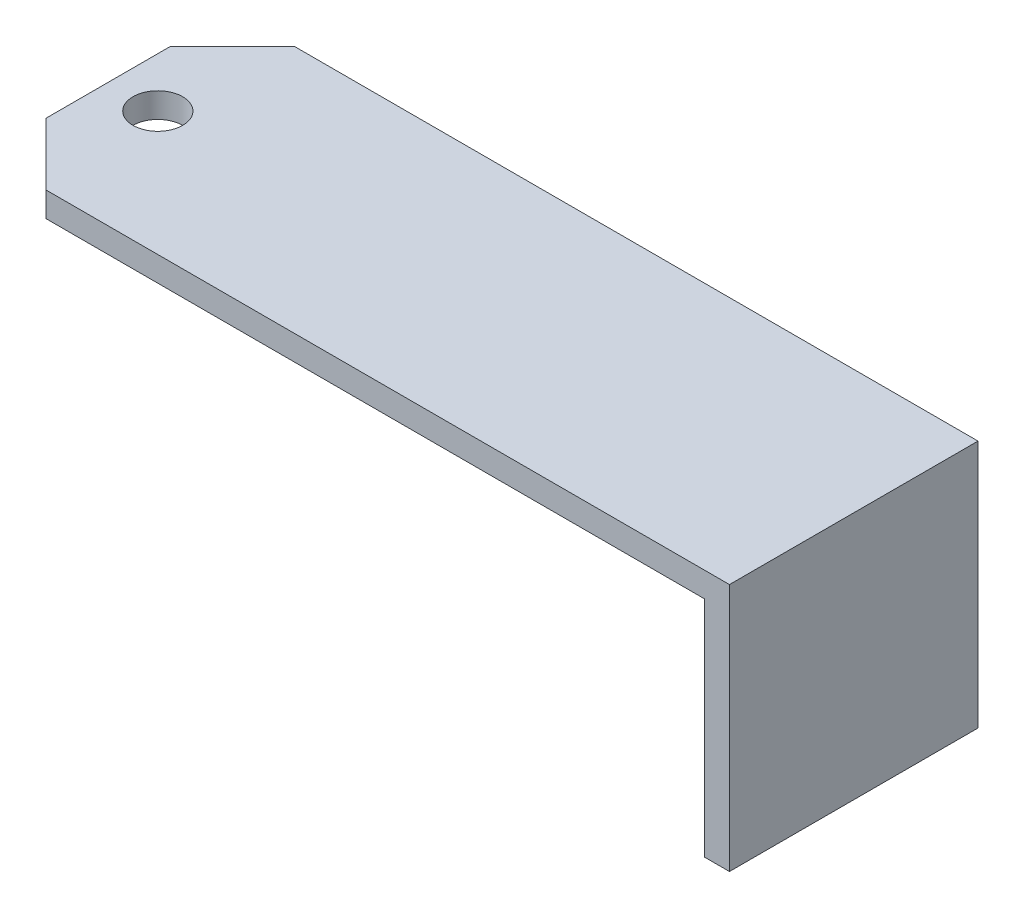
ISO-10303-21;
HEADER;
FILE_DESCRIPTION(('STEP AP214'),'2;1');
FILE_NAME('part.step','',(''),(''),'','','');
FILE_SCHEMA(('AUTOMOTIVE_DESIGN { 1 0 10303 214 1 1 1 1 }'));
ENDSEC;
DATA;
#1=APPLICATION_CONTEXT('core data for automotive mechanical design processes');
#2=APPLICATION_PROTOCOL_DEFINITION('international standard','automotive_design',2000,#1);
#3=PRODUCT_CONTEXT('',#1,'mechanical');
#4=PRODUCT('Part','Part','',(#3));
#5=PRODUCT_RELATED_PRODUCT_CATEGORY('part','',(#4));
#6=PRODUCT_DEFINITION_FORMATION('','',#4);
#7=PRODUCT_DEFINITION_CONTEXT('part definition',#1,'design');
#8=PRODUCT_DEFINITION('design','',#6,#7);
#9=PRODUCT_DEFINITION_SHAPE('','',#8);
#10=(LENGTH_UNIT() NAMED_UNIT(*) SI_UNIT(.MILLI.,.METRE.));
#11=(NAMED_UNIT(*) PLANE_ANGLE_UNIT() SI_UNIT($,.RADIAN.));
#12=(NAMED_UNIT(*) SI_UNIT($,.STERADIAN.) SOLID_ANGLE_UNIT());
#13=UNCERTAINTY_MEASURE_WITH_UNIT(LENGTH_MEASURE(1.E-05),#10,'distance_accuracy_value','');
#14=(GEOMETRIC_REPRESENTATION_CONTEXT(3) GLOBAL_UNCERTAINTY_ASSIGNED_CONTEXT((#13)) GLOBAL_UNIT_ASSIGNED_CONTEXT((#10,
#11,#12)) REPRESENTATION_CONTEXT('',''));
#15=CARTESIAN_POINT('',(0.,0.,0.));
#16=DIRECTION('',(0.,0.,1.));
#17=DIRECTION('',(1.,0.,0.));
#18=AXIS2_PLACEMENT_3D('',#15,#16,#17);
#19=CARTESIAN_POINT('',(0.,0.,0.));
#20=DIRECTION('',(1.,0.,0.));
#21=DIRECTION('',(0.,1.,0.));
#22=AXIS2_PLACEMENT_3D('',#19,#20,#21);
#23=PLANE('',#22);
#24=DIRECTION('',(0.,-1.,0.));
#25=VECTOR('',#24,1.);
#26=CARTESIAN_POINT('',(0.,0.,10.));
#27=LINE('',#26,#25);
#28=CARTESIAN_POINT('',(0.,0.,10.));
#29=VERTEX_POINT('',#28);
#30=CARTESIAN_POINT('',(0.,-20.,10.));
#31=VERTEX_POINT('',#30);
#32=EDGE_CURVE('E179',#29,#31,#27,.T.);
#33=ORIENTED_EDGE('',*,*,#32,.T.);
#34=DIRECTION('',(0.,0.,-1.));
#35=VECTOR('',#34,1.);
#36=CARTESIAN_POINT('',(0.,-20.,10.));
#37=LINE('',#36,#35);
#38=CARTESIAN_POINT('',(0.,-20.,-10.));
#39=VERTEX_POINT('',#38);
#40=EDGE_CURVE('E18',#31,#39,#37,.T.);
#41=ORIENTED_EDGE('',*,*,#40,.T.);
#42=DIRECTION('',(0.,1.,0.));
#43=VECTOR('',#42,1.);
#44=CARTESIAN_POINT('',(0.,-20.,-10.));
#45=LINE('',#44,#43);
#46=CARTESIAN_POINT('',(0.,0.,-10.));
#47=VERTEX_POINT('',#46);
#48=EDGE_CURVE('E194',#39,#47,#45,.T.);
#49=ORIENTED_EDGE('',*,*,#48,.T.);
#50=DIRECTION('',(0.,0.,1.));
#51=VECTOR('',#50,1.);
#52=CARTESIAN_POINT('',(0.,0.,-10.));
#53=LINE('',#52,#51);
#54=EDGE_CURVE('E9',#47,#29,#53,.T.);
#55=ORIENTED_EDGE('',*,*,#54,.T.);
#56=EDGE_LOOP('',(#33,#41,#49,#55));
#57=FACE_BOUND('',#56,.T.);
#58=ADVANCED_FACE('F15',(#57),#23,.T.);
#59=CARTESIAN_POINT('',(-60.,0.,0.));
#60=DIRECTION('',(0.,1.,0.));
#61=DIRECTION('',(1.,0.,0.));
#62=AXIS2_PLACEMENT_3D('',#59,#60,#61);
#63=PLANE('',#62);
#64=CARTESIAN_POINT('',(-56.,0.,0.));
#65=DIRECTION('',(0.,-1.,0.));
#66=DIRECTION('',(-1.,0.,0.));
#67=AXIS2_PLACEMENT_3D('',#64,#65,#66);
#68=CIRCLE('',#67,2.);
#69=CARTESIAN_POINT('',(-54.,0.,0.));
#70=VERTEX_POINT('',#69);
#71=EDGE_CURVE('E189',#70,#70,#68,.T.);
#72=ORIENTED_EDGE('',*,*,#71,.T.);
#73=EDGE_LOOP('',(#72));
#74=FACE_BOUND('',#73,.T.);
#75=DIRECTION('',(0.707106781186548,0.,-0.707106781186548));
#76=VECTOR('',#75,1.);
#77=CARTESIAN_POINT('',(-60.,0.,-5.));
#78=LINE('',#77,#76);
#79=CARTESIAN_POINT('',(-60.,0.,-5.));
#80=VERTEX_POINT('',#79);
#81=CARTESIAN_POINT('',(-55.,0.,-10.));
#82=VERTEX_POINT('',#81);
#83=EDGE_CURVE('E132',#80,#82,#78,.T.);
#84=ORIENTED_EDGE('',*,*,#83,.F.);
#85=DIRECTION('',(0.,0.,-1.));
#86=VECTOR('',#85,1.);
#87=CARTESIAN_POINT('',(-60.,0.,5.));
#88=LINE('',#87,#86);
#89=CARTESIAN_POINT('',(-60.,0.,5.));
#90=VERTEX_POINT('',#89);
#91=EDGE_CURVE('E124',#90,#80,#88,.T.);
#92=ORIENTED_EDGE('',*,*,#91,.F.);
#93=DIRECTION('',(-0.707106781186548,0.,-0.707106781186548));
#94=VECTOR('',#93,1.);
#95=CARTESIAN_POINT('',(-55.,0.,10.));
#96=LINE('',#95,#94);
#97=CARTESIAN_POINT('',(-55.,0.,10.));
#98=VERTEX_POINT('',#97);
#99=EDGE_CURVE('E152',#98,#90,#96,.T.);
#100=ORIENTED_EDGE('',*,*,#99,.F.);
#101=DIRECTION('',(1.,0.,0.));
#102=VECTOR('',#101,1.);
#103=CARTESIAN_POINT('',(-55.,0.,10.));
#104=LINE('',#103,#102);
#105=EDGE_CURVE('E185',#98,#29,#104,.T.);
#106=ORIENTED_EDGE('',*,*,#105,.T.);
#107=ORIENTED_EDGE('',*,*,#54,.F.);
#108=DIRECTION('',(-1.,0.,0.));
#109=VECTOR('',#108,1.);
#110=CARTESIAN_POINT('',(0.,0.,-10.));
#111=LINE('',#110,#109);
#112=EDGE_CURVE('E192',#47,#82,#111,.T.);
#113=ORIENTED_EDGE('',*,*,#112,.T.);
#114=EDGE_LOOP('',(#84,#92,#100,#106,#107,#113));
#115=FACE_BOUND('',#114,.T.);
#116=ADVANCED_FACE('F220',(#74,#115),#63,.T.);
#117=CARTESIAN_POINT('',(-2.,-20.,0.));
#118=DIRECTION('',(-1.,0.,0.));
#119=DIRECTION('',(0.,0.,1.));
#120=AXIS2_PLACEMENT_3D('',#117,#118,#119);
#121=PLANE('',#120);
#122=DIRECTION('',(0.,1.,0.));
#123=VECTOR('',#122,1.);
#124=CARTESIAN_POINT('',(-2.,-20.,10.));
#125=LINE('',#124,#123);
#126=CARTESIAN_POINT('',(-2.,-20.,10.));
#127=VERTEX_POINT('',#126);
#128=CARTESIAN_POINT('',(-2.,-2.,10.));
#129=VERTEX_POINT('',#128);
#130=EDGE_CURVE('E161',#127,#129,#125,.T.);
#131=ORIENTED_EDGE('',*,*,#130,.T.);
#132=DIRECTION('',(0.,0.,-1.));
#133=VECTOR('',#132,1.);
#134=CARTESIAN_POINT('',(-2.,-2.,10.));
#135=LINE('',#134,#133);
#136=CARTESIAN_POINT('',(-2.,-2.,-10.));
#137=VERTEX_POINT('',#136);
#138=EDGE_CURVE('E123',#129,#137,#135,.T.);
#139=ORIENTED_EDGE('',*,*,#138,.T.);
#140=DIRECTION('',(0.,-1.,0.));
#141=VECTOR('',#140,1.);
#142=CARTESIAN_POINT('',(-2.,-2.,-10.));
#143=LINE('',#142,#141);
#144=CARTESIAN_POINT('',(-2.,-20.,-10.));
#145=VERTEX_POINT('',#144);
#146=EDGE_CURVE('E117',#137,#145,#143,.T.);
#147=ORIENTED_EDGE('',*,*,#146,.T.);
#148=DIRECTION('',(0.,0.,-1.));
#149=VECTOR('',#148,1.);
#150=CARTESIAN_POINT('',(-2.,-20.,10.));
#151=LINE('',#150,#149);
#152=EDGE_CURVE('E36',#127,#145,#151,.T.);
#153=ORIENTED_EDGE('',*,*,#152,.F.);
#154=EDGE_LOOP('',(#131,#139,#147,#153));
#155=FACE_BOUND('',#154,.T.);
#156=ADVANCED_FACE('F235',(#155),#121,.T.);
#157=CARTESIAN_POINT('',(0.,-20.,0.));
#158=DIRECTION('',(0.,-1.,0.));
#159=DIRECTION('',(0.,0.,-1.));
#160=AXIS2_PLACEMENT_3D('',#157,#158,#159);
#161=PLANE('',#160);
#162=DIRECTION('',(-1.,0.,0.));
#163=VECTOR('',#162,1.);
#164=CARTESIAN_POINT('',(0.,-20.,10.));
#165=LINE('',#164,#163);
#166=EDGE_CURVE('E164',#31,#127,#165,.T.);
#167=ORIENTED_EDGE('',*,*,#166,.T.);
#168=ORIENTED_EDGE('',*,*,#152,.T.);
#169=DIRECTION('',(1.,0.,0.));
#170=VECTOR('',#169,1.);
#171=CARTESIAN_POINT('',(-2.,-20.,-10.));
#172=LINE('',#171,#170);
#173=EDGE_CURVE('E198',#145,#39,#172,.T.);
#174=ORIENTED_EDGE('',*,*,#173,.T.);
#175=ORIENTED_EDGE('',*,*,#40,.F.);
#176=EDGE_LOOP('',(#167,#168,#174,#175));
#177=FACE_BOUND('',#176,.T.);
#178=ADVANCED_FACE('F228',(#177),#161,.T.);
#179=CARTESIAN_POINT('',(-23.475,-3.475,-10.));
#180=DIRECTION('',(0.,0.,1.));
#181=DIRECTION('',(1.,0.,0.));
#182=AXIS2_PLACEMENT_3D('',#179,#180,#181);
#183=PLANE('',#182);
#184=DIRECTION('',(0.,-1.,0.));
#185=VECTOR('',#184,1.);
#186=CARTESIAN_POINT('',(-55.,0.,-10.));
#187=LINE('',#186,#185);
#188=CARTESIAN_POINT('',(-55.,-2.,-10.));
#189=VERTEX_POINT('',#188);
#190=EDGE_CURVE('E114',#82,#189,#187,.T.);
#191=ORIENTED_EDGE('',*,*,#190,.F.);
#192=ORIENTED_EDGE('',*,*,#112,.F.);
#193=ORIENTED_EDGE('',*,*,#48,.F.);
#194=ORIENTED_EDGE('',*,*,#173,.F.);
#195=ORIENTED_EDGE('',*,*,#146,.F.);
#196=DIRECTION('',(1.,0.,0.));
#197=VECTOR('',#196,1.);
#198=CARTESIAN_POINT('',(-55.,-2.,-10.));
#199=LINE('',#198,#197);
#200=EDGE_CURVE('E110',#189,#137,#199,.T.);
#201=ORIENTED_EDGE('',*,*,#200,.F.);
#202=EDGE_LOOP('',(#191,#192,#193,#194,#195,#201));
#203=FACE_BOUND('',#202,.T.);
#204=ADVANCED_FACE('F112',(#203),#183,.F.);
#205=CARTESIAN_POINT('',(-56.,0.,0.));
#206=DIRECTION('',(0.,-1.,0.));
#207=DIRECTION('',(-1.,0.,0.));
#208=AXIS2_PLACEMENT_3D('',#205,#206,#207);
#209=CYLINDRICAL_SURFACE('',#208,2.);
#210=ORIENTED_EDGE('',*,*,#71,.F.);
#211=EDGE_LOOP('',(#210));
#212=FACE_BOUND('',#211,.T.);
#213=CARTESIAN_POINT('',(-56.,-2.00000000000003,0.));
#214=DIRECTION('',(0.,1.,0.));
#215=DIRECTION('',(-1.,0.,0.));
#216=AXIS2_PLACEMENT_3D('',#213,#214,#215);
#217=CIRCLE('',#216,2.);
#218=CARTESIAN_POINT('',(-54.,-2.,0.));
#219=VERTEX_POINT('',#218);
#220=EDGE_CURVE('E149',#219,#219,#217,.T.);
#221=ORIENTED_EDGE('',*,*,#220,.F.);
#222=EDGE_LOOP('',(#221));
#223=FACE_BOUND('',#222,.T.);
#224=ADVANCED_FACE('F227',(#212,#223),#209,.F.);
#225=CARTESIAN_POINT('',(-23.475,-3.475,10.));
#226=DIRECTION('',(0.,0.,1.));
#227=DIRECTION('',(1.,0.,0.));
#228=AXIS2_PLACEMENT_3D('',#225,#226,#227);
#229=PLANE('',#228);
#230=DIRECTION('',(0.,1.,0.));
#231=VECTOR('',#230,1.);
#232=CARTESIAN_POINT('',(-55.,-2.,10.));
#233=LINE('',#232,#231);
#234=CARTESIAN_POINT('',(-55.,-2.,10.));
#235=VERTEX_POINT('',#234);
#236=EDGE_CURVE('E165',#235,#98,#233,.T.);
#237=ORIENTED_EDGE('',*,*,#236,.F.);
#238=DIRECTION('',(-1.,0.,0.));
#239=VECTOR('',#238,1.);
#240=CARTESIAN_POINT('',(-2.,-2.,10.));
#241=LINE('',#240,#239);
#242=EDGE_CURVE('E171',#129,#235,#241,.T.);
#243=ORIENTED_EDGE('',*,*,#242,.F.);
#244=ORIENTED_EDGE('',*,*,#130,.F.);
#245=ORIENTED_EDGE('',*,*,#166,.F.);
#246=ORIENTED_EDGE('',*,*,#32,.F.);
#247=ORIENTED_EDGE('',*,*,#105,.F.);
#248=EDGE_LOOP('',(#237,#243,#244,#245,#246,#247));
#249=FACE_BOUND('',#248,.T.);
#250=ADVANCED_FACE('F241',(#249),#229,.T.);
#251=CARTESIAN_POINT('',(-57.5,-2.7375,7.5));
#252=DIRECTION('',(-0.707106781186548,0.,0.707106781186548));
#253=DIRECTION('',(0.,1.,0.));
#254=AXIS2_PLACEMENT_3D('',#251,#252,#253);
#255=PLANE('',#254);
#256=ORIENTED_EDGE('',*,*,#99,.T.);
#257=DIRECTION('',(0.,-1.,0.));
#258=VECTOR('',#257,1.);
#259=CARTESIAN_POINT('',(-60.,0.,5.));
#260=LINE('',#259,#258);
#261=CARTESIAN_POINT('',(-60.,-2.,5.));
#262=VERTEX_POINT('',#261);
#263=EDGE_CURVE('E158',#90,#262,#260,.T.);
#264=ORIENTED_EDGE('',*,*,#263,.T.);
#265=DIRECTION('',(0.707106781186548,0.,0.707106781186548));
#266=VECTOR('',#265,1.);
#267=CARTESIAN_POINT('',(-60.,-2.,5.));
#268=LINE('',#267,#266);
#269=EDGE_CURVE('E153',#262,#235,#268,.T.);
#270=ORIENTED_EDGE('',*,*,#269,.T.);
#271=ORIENTED_EDGE('',*,*,#236,.T.);
#272=EDGE_LOOP('',(#256,#264,#270,#271));
#273=FACE_BOUND('',#272,.T.);
#274=ADVANCED_FACE('F245',(#273),#255,.T.);
#275=CARTESIAN_POINT('',(-2.,-2.,0.));
#276=DIRECTION('',(0.,-1.,0.));
#277=DIRECTION('',(0.,0.,-1.));
#278=AXIS2_PLACEMENT_3D('',#275,#276,#277);
#279=PLANE('',#278);
#280=ORIENTED_EDGE('',*,*,#220,.T.);
#281=EDGE_LOOP('',(#280));
#282=FACE_BOUND('',#281,.T.);
#283=DIRECTION('',(-0.707106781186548,0.,0.707106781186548));
#284=VECTOR('',#283,1.);
#285=CARTESIAN_POINT('',(-55.,-2.,-10.));
#286=LINE('',#285,#284);
#287=CARTESIAN_POINT('',(-60.,-2.,-5.));
#288=VERTEX_POINT('',#287);
#289=EDGE_CURVE('E130',#189,#288,#286,.T.);
#290=ORIENTED_EDGE('',*,*,#289,.F.);
#291=ORIENTED_EDGE('',*,*,#200,.T.);
#292=ORIENTED_EDGE('',*,*,#138,.F.);
#293=ORIENTED_EDGE('',*,*,#242,.T.);
#294=ORIENTED_EDGE('',*,*,#269,.F.);
#295=DIRECTION('',(0.,0.,-1.));
#296=VECTOR('',#295,1.);
#297=CARTESIAN_POINT('',(-60.,-2.,5.));
#298=LINE('',#297,#296);
#299=EDGE_CURVE('E134',#262,#288,#298,.T.);
#300=ORIENTED_EDGE('',*,*,#299,.T.);
#301=EDGE_LOOP('',(#290,#291,#292,#293,#294,#300));
#302=FACE_BOUND('',#301,.T.);
#303=ADVANCED_FACE('F136',(#282,#302),#279,.T.);
#304=CARTESIAN_POINT('',(-60.,-2.,0.));
#305=DIRECTION('',(-1.,0.,0.));
#306=DIRECTION('',(0.,0.,1.));
#307=AXIS2_PLACEMENT_3D('',#304,#305,#306);
#308=PLANE('',#307);
#309=DIRECTION('',(0.,1.,0.));
#310=VECTOR('',#309,1.);
#311=CARTESIAN_POINT('',(-60.,-2.,-5.));
#312=LINE('',#311,#310);
#313=EDGE_CURVE('E140',#288,#80,#312,.T.);
#314=ORIENTED_EDGE('',*,*,#313,.F.);
#315=ORIENTED_EDGE('',*,*,#299,.F.);
#316=ORIENTED_EDGE('',*,*,#263,.F.);
#317=ORIENTED_EDGE('',*,*,#91,.T.);
#318=EDGE_LOOP('',(#314,#315,#316,#317));
#319=FACE_BOUND('',#318,.T.);
#320=ADVANCED_FACE('F269',(#319),#308,.T.);
#321=CARTESIAN_POINT('',(-57.5,-2.7375,-7.5));
#322=DIRECTION('',(-0.707106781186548,0.,-0.707106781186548));
#323=DIRECTION('',(-0.707106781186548,0.,0.707106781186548));
#324=AXIS2_PLACEMENT_3D('',#321,#322,#323);
#325=PLANE('',#324);
#326=ORIENTED_EDGE('',*,*,#289,.T.);
#327=ORIENTED_EDGE('',*,*,#313,.T.);
#328=ORIENTED_EDGE('',*,*,#83,.T.);
#329=ORIENTED_EDGE('',*,*,#190,.T.);
#330=EDGE_LOOP('',(#326,#327,#328,#329));
#331=FACE_BOUND('',#330,.T.);
#332=ADVANCED_FACE('F128',(#331),#325,.T.);
#333=CLOSED_SHELL('',(#58,#116,#156,#178,#204,#224,#250,#274,#303,#320,#332));
#334=MANIFOLD_SOLID_BREP('B1',#333);
#335=ADVANCED_BREP_SHAPE_REPRESENTATION('',(#18,#334),#14);
#336=SHAPE_DEFINITION_REPRESENTATION(#9,#335);
ENDSEC;
END-ISO-10303-21;
